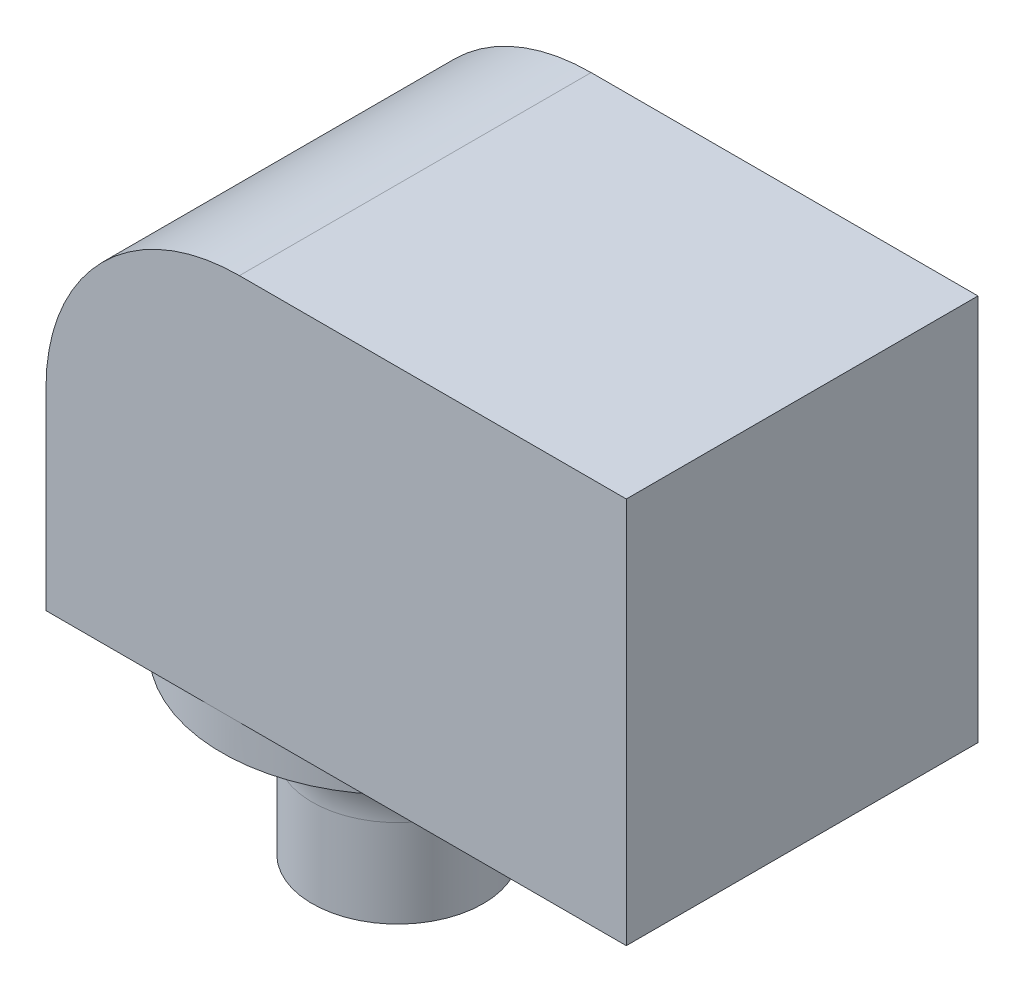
ISO-10303-21;
HEADER;
FILE_DESCRIPTION(('STEP AP214'),'2;1');
FILE_NAME('part.step','',(''),(''),'','','');
FILE_SCHEMA(('AUTOMOTIVE_DESIGN { 1 0 10303 214 1 1 1 1 }'));
ENDSEC;
DATA;
#1=APPLICATION_CONTEXT('core data for automotive mechanical design processes');
#2=APPLICATION_PROTOCOL_DEFINITION('international standard','automotive_design',2000,#1);
#3=PRODUCT_CONTEXT('',#1,'mechanical');
#4=PRODUCT('Part','Part','',(#3));
#5=PRODUCT_RELATED_PRODUCT_CATEGORY('part','',(#4));
#6=PRODUCT_DEFINITION_FORMATION('','',#4);
#7=PRODUCT_DEFINITION_CONTEXT('part definition',#1,'design');
#8=PRODUCT_DEFINITION('design','',#6,#7);
#9=PRODUCT_DEFINITION_SHAPE('','',#8);
#10=(LENGTH_UNIT() NAMED_UNIT(*) SI_UNIT(.MILLI.,.METRE.));
#11=(NAMED_UNIT(*) PLANE_ANGLE_UNIT() SI_UNIT($,.RADIAN.));
#12=(NAMED_UNIT(*) SI_UNIT($,.STERADIAN.) SOLID_ANGLE_UNIT());
#13=UNCERTAINTY_MEASURE_WITH_UNIT(LENGTH_MEASURE(1.E-05),#10,'distance_accuracy_value','');
#14=(GEOMETRIC_REPRESENTATION_CONTEXT(3) GLOBAL_UNCERTAINTY_ASSIGNED_CONTEXT((#13)) GLOBAL_UNIT_ASSIGNED_CONTEXT((#10,
#11,#12)) REPRESENTATION_CONTEXT('',''));
#15=CARTESIAN_POINT('',(0.,0.,0.));
#16=DIRECTION('',(0.,0.,1.));
#17=DIRECTION('',(1.,0.,0.));
#18=AXIS2_PLACEMENT_3D('',#15,#16,#17);
#19=CARTESIAN_POINT('',(16.5,-11.,20.));
#20=DIRECTION('',(0.,1.,0.));
#21=DIRECTION('',(-1.,0.,0.));
#22=AXIS2_PLACEMENT_3D('',#19,#20,#21);
#23=PLANE('',#22);
#24=CARTESIAN_POINT('',(-6.5,-11.,10.));
#25=DIRECTION('',(0.,-1.,0.));
#26=DIRECTION('',(1.,0.,0.));
#27=AXIS2_PLACEMENT_3D('',#24,#25,#26);
#28=CIRCLE('',#27,10.);
#29=CARTESIAN_POINT('',(-6.5,-11.,20.));
#30=VERTEX_POINT('',#29);
#31=CARTESIAN_POINT('',(-16.5,-11.,10.));
#32=VERTEX_POINT('',#31);
#33=EDGE_CURVE('E90',#30,#32,#28,.T.);
#34=ORIENTED_EDGE('',*,*,#33,.F.);
#35=DIRECTION('',(1.,0.,0.));
#36=VECTOR('',#35,1.);
#37=CARTESIAN_POINT('',(16.5,-11.,20.));
#38=LINE('',#37,#36);
#39=CARTESIAN_POINT('',(-16.5,-11.,20.));
#40=VERTEX_POINT('',#39);
#41=EDGE_CURVE('E72',#40,#30,#38,.T.);
#42=ORIENTED_EDGE('',*,*,#41,.F.);
#43=DIRECTION('',(0.,0.,-1.));
#44=VECTOR('',#43,1.);
#45=CARTESIAN_POINT('',(-16.5,-11.,20.));
#46=LINE('',#45,#44);
#47=EDGE_CURVE('E91',#40,#32,#46,.T.);
#48=ORIENTED_EDGE('',*,*,#47,.T.);
#49=EDGE_LOOP('',(#34,#42,#48));
#50=FACE_BOUND('',#49,.T.);
#51=ADVANCED_FACE('F15',(#50),#23,.F.);
#52=CARTESIAN_POINT('',(-6.5,-11.,0.));
#53=VERTEX_POINT('',#52);
#54=EDGE_CURVE('E30',#32,#53,#28,.T.);
#55=ORIENTED_EDGE('',*,*,#54,.F.);
#56=CARTESIAN_POINT('',(-16.5,-11.,0.));
#57=VERTEX_POINT('',#56);
#58=EDGE_CURVE('E122',#32,#57,#46,.T.);
#59=ORIENTED_EDGE('',*,*,#58,.T.);
#60=DIRECTION('',(1.,0.,0.));
#61=VECTOR('',#60,1.);
#62=CARTESIAN_POINT('',(16.5,-11.,0.));
#63=LINE('',#62,#61);
#64=EDGE_CURVE('E113',#57,#53,#63,.T.);
#65=ORIENTED_EDGE('',*,*,#64,.T.);
#66=EDGE_LOOP('',(#55,#59,#65));
#67=FACE_BOUND('',#66,.T.);
#68=ADVANCED_FACE('F147',(#67),#23,.F.);
#69=CARTESIAN_POINT('',(-16.5,-11.,20.));
#70=DIRECTION('',(1.,0.,0.));
#71=DIRECTION('',(0.,0.,-1.));
#72=AXIS2_PLACEMENT_3D('',#69,#70,#71);
#73=PLANE('',#72);
#74=DIRECTION('',(0.,-1.,0.));
#75=VECTOR('',#74,1.);
#76=CARTESIAN_POINT('',(-16.5,-11.,20.));
#77=LINE('',#76,#75);
#78=CARTESIAN_POINT('',(-16.5,0.,20.));
#79=VERTEX_POINT('',#78);
#80=EDGE_CURVE('E78',#79,#40,#77,.T.);
#81=ORIENTED_EDGE('',*,*,#80,.F.);
#82=DIRECTION('',(0.,0.,-1.));
#83=VECTOR('',#82,1.);
#84=CARTESIAN_POINT('',(-16.5,0.,20.));
#85=LINE('',#84,#83);
#86=CARTESIAN_POINT('',(-16.5,0.,0.));
#87=VERTEX_POINT('',#86);
#88=EDGE_CURVE('E124',#79,#87,#85,.T.);
#89=ORIENTED_EDGE('',*,*,#88,.T.);
#90=DIRECTION('',(0.,-1.,0.));
#91=VECTOR('',#90,1.);
#92=CARTESIAN_POINT('',(-16.5,-11.,0.));
#93=LINE('',#92,#91);
#94=EDGE_CURVE('E109',#87,#57,#93,.T.);
#95=ORIENTED_EDGE('',*,*,#94,.T.);
#96=ORIENTED_EDGE('',*,*,#58,.F.);
#97=ORIENTED_EDGE('',*,*,#47,.F.);
#98=EDGE_LOOP('',(#81,#89,#95,#96,#97));
#99=FACE_BOUND('',#98,.T.);
#100=ADVANCED_FACE('F153',(#99),#73,.F.);
#101=EDGE_CURVE('E38',#53,#30,#28,.T.);
#102=ORIENTED_EDGE('',*,*,#101,.F.);
#103=CARTESIAN_POINT('',(16.5,-11.,0.));
#104=VERTEX_POINT('',#103);
#105=EDGE_CURVE('E112',#53,#104,#63,.T.);
#106=ORIENTED_EDGE('',*,*,#105,.T.);
#107=DIRECTION('',(0.,0.,-1.));
#108=VECTOR('',#107,1.);
#109=CARTESIAN_POINT('',(16.5,-11.,20.));
#110=LINE('',#109,#108);
#111=CARTESIAN_POINT('',(16.5,-11.,20.));
#112=VERTEX_POINT('',#111);
#113=EDGE_CURVE('E87',#112,#104,#110,.T.);
#114=ORIENTED_EDGE('',*,*,#113,.F.);
#115=EDGE_CURVE('E75',#30,#112,#38,.T.);
#116=ORIENTED_EDGE('',*,*,#115,.F.);
#117=EDGE_LOOP('',(#102,#106,#114,#116));
#118=FACE_BOUND('',#117,.T.);
#119=ADVANCED_FACE('F85',(#118),#23,.F.);
#120=CARTESIAN_POINT('',(16.5,-11.,20.));
#121=DIRECTION('',(-1.,0.,0.));
#122=DIRECTION('',(0.,0.,1.));
#123=AXIS2_PLACEMENT_3D('',#120,#121,#122);
#124=PLANE('',#123);
#125=DIRECTION('',(0.,1.,0.));
#126=VECTOR('',#125,1.);
#127=CARTESIAN_POINT('',(16.5,-11.,0.));
#128=LINE('',#127,#126);
#129=CARTESIAN_POINT('',(16.5,11.,0.));
#130=VERTEX_POINT('',#129);
#131=EDGE_CURVE('E115',#104,#130,#128,.T.);
#132=ORIENTED_EDGE('',*,*,#131,.T.);
#133=DIRECTION('',(0.,0.,-1.));
#134=VECTOR('',#133,1.);
#135=CARTESIAN_POINT('',(16.5,11.,20.));
#136=LINE('',#135,#134);
#137=CARTESIAN_POINT('',(16.5,11.,20.));
#138=VERTEX_POINT('',#137);
#139=EDGE_CURVE('E108',#138,#130,#136,.T.);
#140=ORIENTED_EDGE('',*,*,#139,.F.);
#141=DIRECTION('',(0.,1.,0.));
#142=VECTOR('',#141,1.);
#143=CARTESIAN_POINT('',(16.5,-11.,20.));
#144=LINE('',#143,#142);
#145=EDGE_CURVE('E83',#112,#138,#144,.T.);
#146=ORIENTED_EDGE('',*,*,#145,.F.);
#147=ORIENTED_EDGE('',*,*,#113,.T.);
#148=EDGE_LOOP('',(#132,#140,#146,#147));
#149=FACE_BOUND('',#148,.T.);
#150=ADVANCED_FACE('F157',(#149),#124,.F.);
#151=CARTESIAN_POINT('',(16.5,11.,20.));
#152=DIRECTION('',(0.,-1.,0.));
#153=DIRECTION('',(1.,0.,0.));
#154=AXIS2_PLACEMENT_3D('',#151,#152,#153);
#155=PLANE('',#154);
#156=DIRECTION('',(-1.,0.,0.));
#157=VECTOR('',#156,1.);
#158=CARTESIAN_POINT('',(16.5,11.,0.));
#159=LINE('',#158,#157);
#160=CARTESIAN_POINT('',(-5.5,11.,0.));
#161=VERTEX_POINT('',#160);
#162=EDGE_CURVE('E103',#130,#161,#159,.T.);
#163=ORIENTED_EDGE('',*,*,#162,.T.);
#164=DIRECTION('',(0.,0.,-1.));
#165=VECTOR('',#164,1.);
#166=CARTESIAN_POINT('',(-5.5,11.,20.));
#167=LINE('',#166,#165);
#168=CARTESIAN_POINT('',(-5.5,11.,20.));
#169=VERTEX_POINT('',#168);
#170=EDGE_CURVE('E98',#161,#169,#167,.F.);
#171=ORIENTED_EDGE('',*,*,#170,.T.);
#172=DIRECTION('',(-1.,0.,0.));
#173=VECTOR('',#172,1.);
#174=CARTESIAN_POINT('',(16.5,11.,20.));
#175=LINE('',#174,#173);
#176=EDGE_CURVE('E106',#138,#169,#175,.T.);
#177=ORIENTED_EDGE('',*,*,#176,.F.);
#178=ORIENTED_EDGE('',*,*,#139,.T.);
#179=EDGE_LOOP('',(#163,#171,#177,#178));
#180=FACE_BOUND('',#179,.T.);
#181=ADVANCED_FACE('F163',(#180),#155,.F.);
#182=CARTESIAN_POINT('',(0.,0.,20.));
#183=DIRECTION('',(0.,0.,1.));
#184=DIRECTION('',(1.,0.,0.));
#185=AXIS2_PLACEMENT_3D('',#182,#183,#184);
#186=PLANE('',#185);
#187=ORIENTED_EDGE('',*,*,#176,.T.);
#188=CARTESIAN_POINT('',(-5.5,0.,20.));
#189=DIRECTION('',(0.,0.,1.));
#190=DIRECTION('',(1.,0.,0.));
#191=AXIS2_PLACEMENT_3D('',#188,#189,#190);
#192=CIRCLE('',#191,11.);
#193=EDGE_CURVE('E97',#169,#79,#192,.T.);
#194=ORIENTED_EDGE('',*,*,#193,.T.);
#195=ORIENTED_EDGE('',*,*,#80,.T.);
#196=ORIENTED_EDGE('',*,*,#41,.T.);
#197=ORIENTED_EDGE('',*,*,#115,.T.);
#198=ORIENTED_EDGE('',*,*,#145,.T.);
#199=EDGE_LOOP('',(#187,#194,#195,#196,#197,#198));
#200=FACE_BOUND('',#199,.T.);
#201=ADVANCED_FACE('F74',(#200),#186,.T.);
#202=CARTESIAN_POINT('',(0.,0.,0.));
#203=DIRECTION('',(0.,0.,1.));
#204=DIRECTION('',(1.,0.,0.));
#205=AXIS2_PLACEMENT_3D('',#202,#203,#204);
#206=PLANE('',#205);
#207=ORIENTED_EDGE('',*,*,#94,.F.);
#208=CARTESIAN_POINT('',(-5.5,0.,0.));
#209=DIRECTION('',(0.,0.,1.));
#210=DIRECTION('',(1.,0.,0.));
#211=AXIS2_PLACEMENT_3D('',#208,#209,#210);
#212=CIRCLE('',#211,11.);
#213=EDGE_CURVE('E127',#87,#161,#212,.F.);
#214=ORIENTED_EDGE('',*,*,#213,.T.);
#215=ORIENTED_EDGE('',*,*,#162,.F.);
#216=ORIENTED_EDGE('',*,*,#131,.F.);
#217=ORIENTED_EDGE('',*,*,#105,.F.);
#218=ORIENTED_EDGE('',*,*,#64,.F.);
#219=EDGE_LOOP('',(#207,#214,#215,#216,#217,#218));
#220=FACE_BOUND('',#219,.T.);
#221=ADVANCED_FACE('F171',(#220),#206,.F.);
#222=CARTESIAN_POINT('',(-5.5,0.,20.));
#223=DIRECTION('',(0.,0.,-1.));
#224=DIRECTION('',(-1.,0.,0.));
#225=AXIS2_PLACEMENT_3D('',#222,#223,#224);
#226=CYLINDRICAL_SURFACE('',#225,11.);
#227=ORIENTED_EDGE('',*,*,#193,.F.);
#228=ORIENTED_EDGE('',*,*,#170,.F.);
#229=ORIENTED_EDGE('',*,*,#213,.F.);
#230=ORIENTED_EDGE('',*,*,#88,.F.);
#231=EDGE_LOOP('',(#227,#228,#229,#230));
#232=FACE_BOUND('',#231,.T.);
#233=ADVANCED_FACE('F169',(#232),#226,.T.);
#234=CARTESIAN_POINT('',(-6.5,-13.,10.));
#235=DIRECTION('',(0.,1.,0.));
#236=DIRECTION('',(-1.,0.,0.));
#237=AXIS2_PLACEMENT_3D('',#234,#235,#236);
#238=CYLINDRICAL_SURFACE('',#237,10.);
#239=CARTESIAN_POINT('',(-6.5,-13.,10.));
#240=DIRECTION('',(0.,-1.,0.));
#241=DIRECTION('',(1.,0.,0.));
#242=AXIS2_PLACEMENT_3D('',#239,#240,#241);
#243=CIRCLE('',#242,10.);
#244=CARTESIAN_POINT('',(3.5,-13.,10.));
#245=VERTEX_POINT('',#244);
#246=EDGE_CURVE('E93',#245,#245,#243,.T.);
#247=ORIENTED_EDGE('',*,*,#246,.F.);
#248=EDGE_LOOP('',(#247));
#249=FACE_BOUND('',#248,.T.);
#250=ORIENTED_EDGE('',*,*,#33,.T.);
#251=ORIENTED_EDGE('',*,*,#54,.T.);
#252=ORIENTED_EDGE('',*,*,#101,.T.);
#253=EDGE_LOOP('',(#250,#251,#252));
#254=FACE_BOUND('',#253,.T.);
#255=ADVANCED_FACE('F96',(#249,#254),#238,.T.);
#256=CARTESIAN_POINT('',(-6.5,-13.,10.));
#257=DIRECTION('',(0.,-1.,0.));
#258=DIRECTION('',(1.,0.,0.));
#259=AXIS2_PLACEMENT_3D('',#256,#257,#258);
#260=PLANE('',#259);
#261=CARTESIAN_POINT('',(-6.5,-13.,10.));
#262=DIRECTION('',(0.,-1.,0.));
#263=DIRECTION('',(1.,0.,0.));
#264=AXIS2_PLACEMENT_3D('',#261,#262,#263);
#265=CIRCLE('',#264,9.864);
#266=CARTESIAN_POINT('',(3.364,-13.,10.));
#267=VERTEX_POINT('',#266);
#268=EDGE_CURVE('E9',#267,#267,#265,.F.);
#269=ORIENTED_EDGE('',*,*,#268,.T.);
#270=EDGE_LOOP('',(#269));
#271=FACE_BOUND('',#270,.T.);
#272=ORIENTED_EDGE('',*,*,#246,.T.);
#273=EDGE_LOOP('',(#272));
#274=FACE_BOUND('',#273,.T.);
#275=ADVANCED_FACE('F178',(#271,#274),#260,.T.);
#276=CARTESIAN_POINT('',(-6.5,-23.,10.));
#277=DIRECTION('',(0.,1.,0.));
#278=DIRECTION('',(-1.,0.,0.));
#279=AXIS2_PLACEMENT_3D('',#276,#277,#278);
#280=CYLINDRICAL_SURFACE('',#279,4.864);
#281=CARTESIAN_POINT('',(-6.5,-18.,10.));
#282=DIRECTION('',(0.,-1.,0.));
#283=DIRECTION('',(1.,0.,0.));
#284=AXIS2_PLACEMENT_3D('',#281,#282,#283);
#285=CIRCLE('',#284,4.864);
#286=CARTESIAN_POINT('',(-1.636,-18.,10.));
#287=VERTEX_POINT('',#286);
#288=EDGE_CURVE('E23',#287,#287,#285,.T.);
#289=ORIENTED_EDGE('',*,*,#288,.T.);
#290=EDGE_LOOP('',(#289));
#291=FACE_BOUND('',#290,.T.);
#292=CARTESIAN_POINT('',(-6.5,-23.,10.));
#293=DIRECTION('',(0.,-1.,0.));
#294=DIRECTION('',(1.,0.,0.));
#295=AXIS2_PLACEMENT_3D('',#292,#293,#294);
#296=CIRCLE('',#295,4.864);
#297=CARTESIAN_POINT('',(-1.636,-23.,10.));
#298=VERTEX_POINT('',#297);
#299=EDGE_CURVE('E94',#298,#298,#296,.T.);
#300=ORIENTED_EDGE('',*,*,#299,.F.);
#301=EDGE_LOOP('',(#300));
#302=FACE_BOUND('',#301,.T.);
#303=ADVANCED_FACE('F132',(#291,#302),#280,.T.);
#304=CARTESIAN_POINT('',(-6.5,-23.,10.));
#305=DIRECTION('',(0.,-1.,0.));
#306=DIRECTION('',(1.,0.,0.));
#307=AXIS2_PLACEMENT_3D('',#304,#305,#306);
#308=PLANE('',#307);
#309=ORIENTED_EDGE('',*,*,#299,.T.);
#310=EDGE_LOOP('',(#309));
#311=FACE_BOUND('',#310,.T.);
#312=ADVANCED_FACE('F136',(#311),#308,.T.);
#313=CARTESIAN_POINT('',(-6.5,-18.,10.));
#314=DIRECTION('',(0.,-1.,0.));
#315=DIRECTION('',(1.,0.,0.));
#316=AXIS2_PLACEMENT_3D('',#313,#314,#315);
#317=TOROIDAL_SURFACE('',#316,9.864,5.);
#318=ORIENTED_EDGE('',*,*,#268,.F.);
#319=EDGE_LOOP('',(#318));
#320=FACE_BOUND('',#319,.T.);
#321=ORIENTED_EDGE('',*,*,#288,.F.);
#322=EDGE_LOOP('',(#321));
#323=FACE_BOUND('',#322,.T.);
#324=ADVANCED_FACE('F17',(#320,#323),#317,.F.);
#325=CLOSED_SHELL('',(#51,#68,#100,#119,#150,#181,#201,#221,#233,#255,#275,#303,#312,#324));
#326=MANIFOLD_SOLID_BREP('B1',#325);
#327=ADVANCED_BREP_SHAPE_REPRESENTATION('',(#18,#326),#14);
#328=SHAPE_DEFINITION_REPRESENTATION(#9,#327);
ENDSEC;
END-ISO-10303-21;
